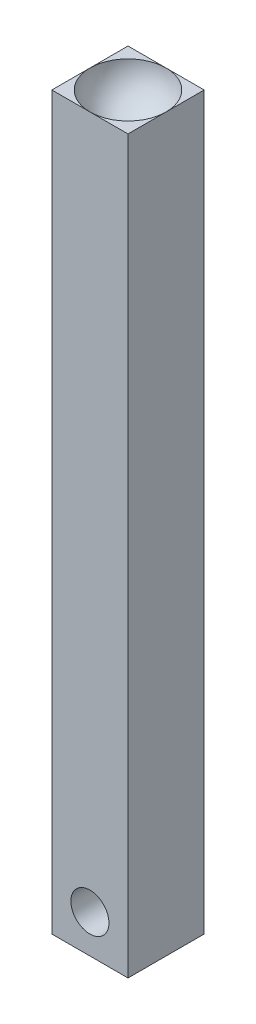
from build123d import *

# Parameters (mm, degrees)
SKETCH1_W           = 10
SKETCH1_H           = 10
BOSS_EXTRUDE1_DEPTH = 96
SKETCH6_R           = 2.5
CUT_EXTRUDE1_DEPTH  = 11


with BuildPart() as part:
    # Sketch1 → Boss-Extrude1 (new body)
    with BuildSketch(Plane(origin=(0, 0, 0), x_dir=(1, 0, 0), z_dir=(0, 1, 0))):
        with Locations((5, 5)):
            Rectangle(SKETCH1_W, SKETCH1_H)
    extrude(amount=BOSS_EXTRUDE1_DEPTH)

    # Sketch5 → Cut-Revolve1 (revolve, cut)
    with BuildSketch(Plane.XY.offset(-5), mode=Mode.PRIVATE) as cut_revolve1_sk:
        with BuildLine():
            Line((5, 96), (10, 96))
            ThreePointArc((10, 96), (8.535533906, 92.464466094), (5, 91))
            Line((5, 91), (5, 96))
        make_face()
    revolve(cut_revolve1_sk.sketch.rotate(Axis((5, 96, -5), (0, -1, 0)), 180), axis=Axis((5, 96, -5), (0, -1, 0)), mode=Mode.SUBTRACT)

    # Sketch6 → Cut-Extrude1 (cut)
    with BuildSketch(Plane.XY):
        with Locations((5, 5)):
            Circle(SKETCH6_R)
    extrude(amount=-CUT_EXTRUDE1_DEPTH, mode=Mode.SUBTRACT)


solid = part.part
